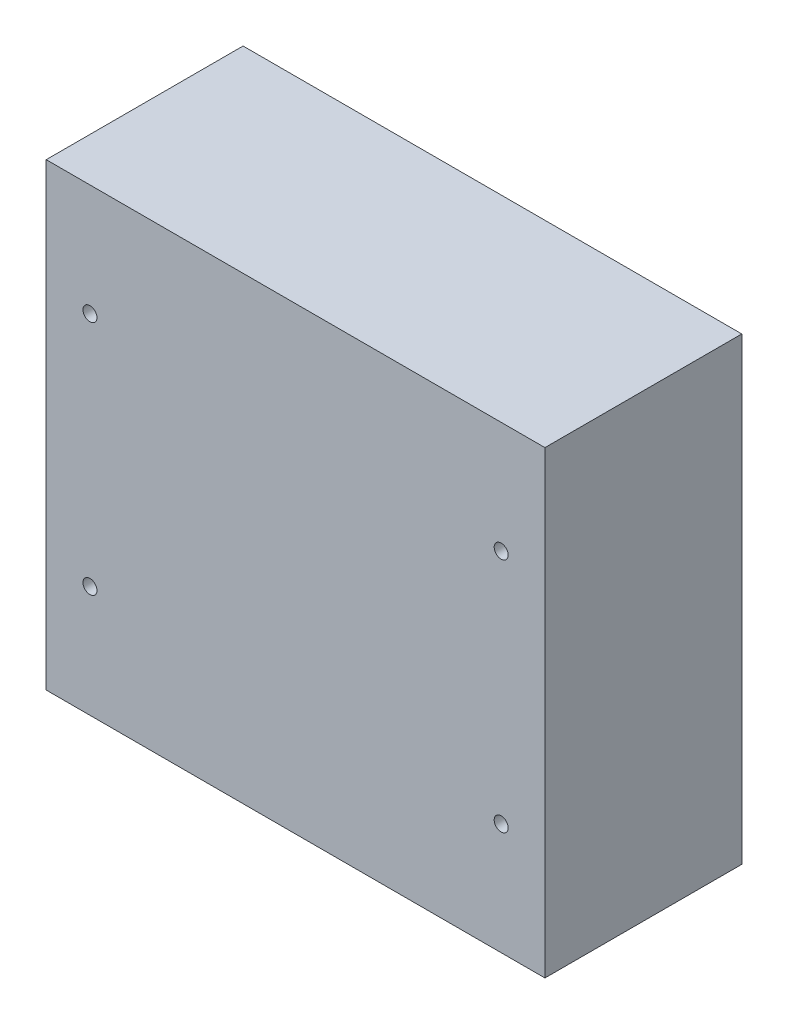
ISO-10303-21;
HEADER;
FILE_DESCRIPTION(('STEP AP214'),'2;1');
FILE_NAME('part.step','',(''),(''),'','','');
FILE_SCHEMA(('AUTOMOTIVE_DESIGN { 1 0 10303 214 1 1 1 1 }'));
ENDSEC;
DATA;
#1=APPLICATION_CONTEXT('core data for automotive mechanical design processes');
#2=APPLICATION_PROTOCOL_DEFINITION('international standard','automotive_design',2000,#1);
#3=PRODUCT_CONTEXT('',#1,'mechanical');
#4=PRODUCT('Part','Part','',(#3));
#5=PRODUCT_RELATED_PRODUCT_CATEGORY('part','',(#4));
#6=PRODUCT_DEFINITION_FORMATION('','',#4);
#7=PRODUCT_DEFINITION_CONTEXT('part definition',#1,'design');
#8=PRODUCT_DEFINITION('design','',#6,#7);
#9=PRODUCT_DEFINITION_SHAPE('','',#8);
#10=(LENGTH_UNIT() NAMED_UNIT(*) SI_UNIT(.MILLI.,.METRE.));
#11=(NAMED_UNIT(*) PLANE_ANGLE_UNIT() SI_UNIT($,.RADIAN.));
#12=(NAMED_UNIT(*) SI_UNIT($,.STERADIAN.) SOLID_ANGLE_UNIT());
#13=UNCERTAINTY_MEASURE_WITH_UNIT(LENGTH_MEASURE(1.E-05),#10,'distance_accuracy_value','');
#14=(GEOMETRIC_REPRESENTATION_CONTEXT(3) GLOBAL_UNCERTAINTY_ASSIGNED_CONTEXT((#13)) GLOBAL_UNIT_ASSIGNED_CONTEXT((#10,
#11,#12)) REPRESENTATION_CONTEXT('',''));
#15=CARTESIAN_POINT('',(0.,0.,0.));
#16=DIRECTION('',(0.,0.,1.));
#17=DIRECTION('',(1.,0.,0.));
#18=AXIS2_PLACEMENT_3D('',#15,#16,#17);
#19=CARTESIAN_POINT('',(27.,44.5,3.));
#20=DIRECTION('',(0.,0.,-1.));
#21=DIRECTION('',(0.,-1.,0.));
#22=AXIS2_PLACEMENT_3D('',#19,#20,#21);
#23=PLANE('',#22);
#24=CARTESIAN_POINT('',(27.,44.5,3.));
#25=DIRECTION('',(0.,0.,-1.));
#26=DIRECTION('',(-1.,0.,0.));
#27=AXIS2_PLACEMENT_3D('',#24,#25,#26);
#28=CIRCLE('',#27,1.1);
#29=CARTESIAN_POINT('',(25.9,44.5,3.));
#30=VERTEX_POINT('',#29);
#31=EDGE_CURVE('E282',#30,#30,#28,.T.);
#32=ORIENTED_EDGE('',*,*,#31,.T.);
#33=EDGE_LOOP('',(#32));
#34=FACE_BOUND('',#33,.T.);
#35=ADVANCED_FACE('F17',(#34),#23,.T.);
#36=CARTESIAN_POINT('',(-27.,44.5,3.));
#37=DIRECTION('',(0.,0.,1.));
#38=DIRECTION('',(1.,0.,0.));
#39=AXIS2_PLACEMENT_3D('',#36,#37,#38);
#40=PLANE('',#39);
#41=CARTESIAN_POINT('',(-27.,44.5,3.));
#42=DIRECTION('',(0.,0.,-1.));
#43=DIRECTION('',(1.,0.,0.));
#44=AXIS2_PLACEMENT_3D('',#41,#42,#43);
#45=CIRCLE('',#44,1.1);
#46=CARTESIAN_POINT('',(-25.9,44.5,3.));
#47=VERTEX_POINT('',#46);
#48=EDGE_CURVE('E264',#47,#47,#45,.T.);
#49=ORIENTED_EDGE('',*,*,#48,.T.);
#50=EDGE_LOOP('',(#49));
#51=FACE_BOUND('',#50,.T.);
#52=ADVANCED_FACE('F325',(#51),#40,.F.);
#53=CARTESIAN_POINT('',(-47.,-27.,35.));
#54=DIRECTION('',(0.,0.,1.));
#55=DIRECTION('',(1.,0.,0.));
#56=AXIS2_PLACEMENT_3D('',#53,#54,#55);
#57=PLANE('',#56);
#58=CARTESIAN_POINT('',(-47.,-27.,35.));
#59=DIRECTION('',(0.,0.,1.));
#60=DIRECTION('',(1.,0.,0.));
#61=AXIS2_PLACEMENT_3D('',#58,#59,#60);
#62=CIRCLE('',#61,1.6);
#63=CARTESIAN_POINT('',(-45.4,-27.,35.));
#64=VERTEX_POINT('',#63);
#65=EDGE_CURVE('E243',#64,#64,#62,.T.);
#66=ORIENTED_EDGE('',*,*,#65,.T.);
#67=EDGE_LOOP('',(#66));
#68=FACE_BOUND('',#67,.T.);
#69=ADVANCED_FACE('F329',(#68),#57,.T.);
#70=CARTESIAN_POINT('',(47.,-27.,35.));
#71=DIRECTION('',(0.,0.,1.));
#72=DIRECTION('',(1.,0.,0.));
#73=AXIS2_PLACEMENT_3D('',#70,#71,#72);
#74=PLANE('',#73);
#75=CARTESIAN_POINT('',(47.,-27.,35.));
#76=DIRECTION('',(0.,0.,1.));
#77=DIRECTION('',(1.,0.,0.));
#78=AXIS2_PLACEMENT_3D('',#75,#76,#77);
#79=CIRCLE('',#78,1.6);
#80=CARTESIAN_POINT('',(48.6,-27.,35.));
#81=VERTEX_POINT('',#80);
#82=EDGE_CURVE('E222',#81,#81,#79,.T.);
#83=ORIENTED_EDGE('',*,*,#82,.T.);
#84=EDGE_LOOP('',(#83));
#85=FACE_BOUND('',#84,.T.);
#86=ADVANCED_FACE('F334',(#85),#74,.T.);
#87=CARTESIAN_POINT('',(47.,27.,35.));
#88=DIRECTION('',(0.,0.,1.));
#89=DIRECTION('',(1.,0.,0.));
#90=AXIS2_PLACEMENT_3D('',#87,#88,#89);
#91=PLANE('',#90);
#92=CARTESIAN_POINT('',(47.,27.,35.));
#93=DIRECTION('',(0.,0.,1.));
#94=DIRECTION('',(1.,0.,0.));
#95=AXIS2_PLACEMENT_3D('',#92,#93,#94);
#96=CIRCLE('',#95,1.6);
#97=CARTESIAN_POINT('',(48.6,27.,35.));
#98=VERTEX_POINT('',#97);
#99=EDGE_CURVE('E202',#98,#98,#96,.T.);
#100=ORIENTED_EDGE('',*,*,#99,.T.);
#101=EDGE_LOOP('',(#100));
#102=FACE_BOUND('',#101,.T.);
#103=ADVANCED_FACE('F340',(#102),#91,.T.);
#104=CARTESIAN_POINT('',(-47.,27.,35.));
#105=DIRECTION('',(0.,0.,1.));
#106=DIRECTION('',(1.,0.,0.));
#107=AXIS2_PLACEMENT_3D('',#104,#105,#106);
#108=PLANE('',#107);
#109=CARTESIAN_POINT('',(-47.,27.,35.));
#110=DIRECTION('',(0.,0.,1.));
#111=DIRECTION('',(1.,0.,0.));
#112=AXIS2_PLACEMENT_3D('',#109,#110,#111);
#113=CIRCLE('',#112,1.6);
#114=CARTESIAN_POINT('',(-45.4,27.,35.));
#115=VERTEX_POINT('',#114);
#116=EDGE_CURVE('E181',#115,#115,#113,.T.);
#117=ORIENTED_EDGE('',*,*,#116,.T.);
#118=EDGE_LOOP('',(#117));
#119=FACE_BOUND('',#118,.T.);
#120=ADVANCED_FACE('F342',(#119),#108,.T.);
#121=CARTESIAN_POINT('',(0.,0.,0.));
#122=DIRECTION('',(0.,0.,-1.));
#123=DIRECTION('',(0.,-1.,0.));
#124=AXIS2_PLACEMENT_3D('',#121,#122,#123);
#125=PLANE('',#124);
#126=CARTESIAN_POINT('',(-27.,44.5,0.));
#127=DIRECTION('',(0.,0.,-1.));
#128=DIRECTION('',(1.,0.,0.));
#129=AXIS2_PLACEMENT_3D('',#126,#127,#128);
#130=CIRCLE('',#129,1.1);
#131=CARTESIAN_POINT('',(-25.9,44.5,0.));
#132=VERTEX_POINT('',#131);
#133=EDGE_CURVE('E254',#132,#132,#130,.T.);
#134=ORIENTED_EDGE('',*,*,#133,.F.);
#135=EDGE_LOOP('',(#134));
#136=FACE_BOUND('',#135,.T.);
#137=CARTESIAN_POINT('',(27.,44.5,0.));
#138=DIRECTION('',(0.,0.,-1.));
#139=DIRECTION('',(-1.,0.,0.));
#140=AXIS2_PLACEMENT_3D('',#137,#138,#139);
#141=CIRCLE('',#140,1.1);
#142=CARTESIAN_POINT('',(25.9,44.5,0.));
#143=VERTEX_POINT('',#142);
#144=EDGE_CURVE('E273',#143,#143,#141,.T.);
#145=ORIENTED_EDGE('',*,*,#144,.F.);
#146=EDGE_LOOP('',(#145));
#147=FACE_BOUND('',#146,.T.);
#148=DIRECTION('',(0.,1.,0.));
#149=VECTOR('',#148,1.);
#150=CARTESIAN_POINT('',(57.,-52.5,0.));
#151=LINE('',#150,#149);
#152=CARTESIAN_POINT('',(57.,-52.5,0.));
#153=VERTEX_POINT('',#152);
#154=CARTESIAN_POINT('',(57.,52.5,0.));
#155=VERTEX_POINT('',#154);
#156=EDGE_CURVE('E95',#153,#155,#151,.T.);
#157=ORIENTED_EDGE('',*,*,#156,.F.);
#158=DIRECTION('',(1.,0.,0.));
#159=VECTOR('',#158,1.);
#160=CARTESIAN_POINT('',(-57.,-52.5,0.));
#161=LINE('',#160,#159);
#162=CARTESIAN_POINT('',(-57.,-52.5,0.));
#163=VERTEX_POINT('',#162);
#164=EDGE_CURVE('E25',#163,#153,#161,.T.);
#165=ORIENTED_EDGE('',*,*,#164,.F.);
#166=DIRECTION('',(0.,-1.,0.));
#167=VECTOR('',#166,1.);
#168=CARTESIAN_POINT('',(-57.,-52.5,0.));
#169=LINE('',#168,#167);
#170=CARTESIAN_POINT('',(-57.,52.5,0.));
#171=VERTEX_POINT('',#170);
#172=EDGE_CURVE('E104',#171,#163,#169,.T.);
#173=ORIENTED_EDGE('',*,*,#172,.F.);
#174=DIRECTION('',(-1.,0.,0.));
#175=VECTOR('',#174,1.);
#176=CARTESIAN_POINT('',(-57.,52.5,0.));
#177=LINE('',#176,#175);
#178=EDGE_CURVE('E84',#155,#171,#177,.T.);
#179=ORIENTED_EDGE('',*,*,#178,.F.);
#180=EDGE_LOOP('',(#157,#165,#173,#179));
#181=FACE_BOUND('',#180,.T.);
#182=ADVANCED_FACE('F345',(#136,#147,#181),#125,.T.);
#183=CARTESIAN_POINT('',(0.,0.,45.));
#184=DIRECTION('',(0.,0.,-1.));
#185=DIRECTION('',(0.,-1.,0.));
#186=AXIS2_PLACEMENT_3D('',#183,#184,#185);
#187=PLANE('',#186);
#188=CARTESIAN_POINT('',(-47.,27.,45.));
#189=DIRECTION('',(0.,0.,1.));
#190=DIRECTION('',(1.,0.,0.));
#191=AXIS2_PLACEMENT_3D('',#188,#189,#190);
#192=CIRCLE('',#191,1.6);
#193=CARTESIAN_POINT('',(-45.4,27.,45.));
#194=VERTEX_POINT('',#193);
#195=EDGE_CURVE('E173',#194,#194,#192,.T.);
#196=ORIENTED_EDGE('',*,*,#195,.F.);
#197=EDGE_LOOP('',(#196));
#198=FACE_BOUND('',#197,.T.);
#199=CARTESIAN_POINT('',(47.,27.,45.));
#200=DIRECTION('',(0.,0.,1.));
#201=DIRECTION('',(1.,0.,0.));
#202=AXIS2_PLACEMENT_3D('',#199,#200,#201);
#203=CIRCLE('',#202,1.6);
#204=CARTESIAN_POINT('',(48.6,27.,45.));
#205=VERTEX_POINT('',#204);
#206=EDGE_CURVE('E192',#205,#205,#203,.T.);
#207=ORIENTED_EDGE('',*,*,#206,.F.);
#208=EDGE_LOOP('',(#207));
#209=FACE_BOUND('',#208,.T.);
#210=CARTESIAN_POINT('',(47.,-27.,45.));
#211=DIRECTION('',(0.,0.,1.));
#212=DIRECTION('',(1.,0.,0.));
#213=AXIS2_PLACEMENT_3D('',#210,#211,#212);
#214=CIRCLE('',#213,1.6);
#215=CARTESIAN_POINT('',(48.6,-27.,45.));
#216=VERTEX_POINT('',#215);
#217=EDGE_CURVE('E212',#216,#216,#214,.T.);
#218=ORIENTED_EDGE('',*,*,#217,.F.);
#219=EDGE_LOOP('',(#218));
#220=FACE_BOUND('',#219,.T.);
#221=CARTESIAN_POINT('',(-47.,-27.,45.));
#222=DIRECTION('',(0.,0.,1.));
#223=DIRECTION('',(1.,0.,0.));
#224=AXIS2_PLACEMENT_3D('',#221,#222,#223);
#225=CIRCLE('',#224,1.6);
#226=CARTESIAN_POINT('',(-45.4,-27.,45.));
#227=VERTEX_POINT('',#226);
#228=EDGE_CURVE('E232',#227,#227,#225,.T.);
#229=ORIENTED_EDGE('',*,*,#228,.F.);
#230=EDGE_LOOP('',(#229));
#231=FACE_BOUND('',#230,.T.);
#232=DIRECTION('',(0.,1.,0.));
#233=VECTOR('',#232,1.);
#234=CARTESIAN_POINT('',(57.,-52.5,45.));
#235=LINE('',#234,#233);
#236=CARTESIAN_POINT('',(57.,-52.5,45.));
#237=VERTEX_POINT('',#236);
#238=CARTESIAN_POINT('',(57.,52.5,45.));
#239=VERTEX_POINT('',#238);
#240=EDGE_CURVE('E74',#237,#239,#235,.T.);
#241=ORIENTED_EDGE('',*,*,#240,.T.);
#242=DIRECTION('',(-1.,0.,0.));
#243=VECTOR('',#242,1.);
#244=CARTESIAN_POINT('',(-57.,52.5,45.));
#245=LINE('',#244,#243);
#246=CARTESIAN_POINT('',(-57.,52.5,45.));
#247=VERTEX_POINT('',#246);
#248=EDGE_CURVE('E103',#239,#247,#245,.T.);
#249=ORIENTED_EDGE('',*,*,#248,.T.);
#250=DIRECTION('',(0.,-1.,0.));
#251=VECTOR('',#250,1.);
#252=CARTESIAN_POINT('',(-57.,-52.5,45.));
#253=LINE('',#252,#251);
#254=CARTESIAN_POINT('',(-57.,-52.5,45.));
#255=VERTEX_POINT('',#254);
#256=EDGE_CURVE('E76',#247,#255,#253,.T.);
#257=ORIENTED_EDGE('',*,*,#256,.T.);
#258=DIRECTION('',(1.,0.,0.));
#259=VECTOR('',#258,1.);
#260=CARTESIAN_POINT('',(-57.,-52.5,45.));
#261=LINE('',#260,#259);
#262=EDGE_CURVE('E11',#255,#237,#261,.T.);
#263=ORIENTED_EDGE('',*,*,#262,.T.);
#264=EDGE_LOOP('',(#241,#249,#257,#263));
#265=FACE_BOUND('',#264,.T.);
#266=ADVANCED_FACE('F71',(#198,#209,#220,#231,#265),#187,.F.);
#267=CARTESIAN_POINT('',(-57.,-52.5,45.));
#268=DIRECTION('',(0.,1.,0.));
#269=DIRECTION('',(1.,0.,0.));
#270=AXIS2_PLACEMENT_3D('',#267,#268,#269);
#271=PLANE('',#270);
#272=ORIENTED_EDGE('',*,*,#164,.T.);
#273=DIRECTION('',(0.,0.,-1.));
#274=VECTOR('',#273,1.);
#275=CARTESIAN_POINT('',(57.,-52.5,45.));
#276=LINE('',#275,#274);
#277=EDGE_CURVE('E79',#237,#153,#276,.T.);
#278=ORIENTED_EDGE('',*,*,#277,.F.);
#279=ORIENTED_EDGE('',*,*,#262,.F.);
#280=DIRECTION('',(0.,0.,-1.));
#281=VECTOR('',#280,1.);
#282=CARTESIAN_POINT('',(-57.,-52.5,45.));
#283=LINE('',#282,#281);
#284=EDGE_CURVE('E108',#255,#163,#283,.T.);
#285=ORIENTED_EDGE('',*,*,#284,.T.);
#286=EDGE_LOOP('',(#272,#278,#279,#285));
#287=FACE_BOUND('',#286,.T.);
#288=ADVANCED_FACE('F80',(#287),#271,.F.);
#289=CARTESIAN_POINT('',(-57.,-52.5,45.));
#290=DIRECTION('',(1.,0.,0.));
#291=DIRECTION('',(0.,1.,0.));
#292=AXIS2_PLACEMENT_3D('',#289,#290,#291);
#293=PLANE('',#292);
#294=ORIENTED_EDGE('',*,*,#172,.T.);
#295=ORIENTED_EDGE('',*,*,#284,.F.);
#296=ORIENTED_EDGE('',*,*,#256,.F.);
#297=DIRECTION('',(0.,0.,-1.));
#298=VECTOR('',#297,1.);
#299=CARTESIAN_POINT('',(-57.,52.5,45.));
#300=LINE('',#299,#298);
#301=EDGE_CURVE('E99',#247,#171,#300,.T.);
#302=ORIENTED_EDGE('',*,*,#301,.T.);
#303=EDGE_LOOP('',(#294,#295,#296,#302));
#304=FACE_BOUND('',#303,.T.);
#305=ADVANCED_FACE('F347',(#304),#293,.F.);
#306=CARTESIAN_POINT('',(-57.,52.5,45.));
#307=DIRECTION('',(0.,-1.,0.));
#308=DIRECTION('',(0.,0.,-1.));
#309=AXIS2_PLACEMENT_3D('',#306,#307,#308);
#310=PLANE('',#309);
#311=ORIENTED_EDGE('',*,*,#178,.T.);
#312=ORIENTED_EDGE('',*,*,#301,.F.);
#313=ORIENTED_EDGE('',*,*,#248,.F.);
#314=DIRECTION('',(0.,0.,-1.));
#315=VECTOR('',#314,1.);
#316=CARTESIAN_POINT('',(57.,52.5,45.));
#317=LINE('',#316,#315);
#318=EDGE_CURVE('E88',#239,#155,#317,.T.);
#319=ORIENTED_EDGE('',*,*,#318,.T.);
#320=EDGE_LOOP('',(#311,#312,#313,#319));
#321=FACE_BOUND('',#320,.T.);
#322=ADVANCED_FACE('F350',(#321),#310,.F.);
#323=CARTESIAN_POINT('',(57.,-52.5,45.));
#324=DIRECTION('',(-1.,0.,0.));
#325=DIRECTION('',(0.,0.,1.));
#326=AXIS2_PLACEMENT_3D('',#323,#324,#325);
#327=PLANE('',#326);
#328=ORIENTED_EDGE('',*,*,#156,.T.);
#329=ORIENTED_EDGE('',*,*,#318,.F.);
#330=ORIENTED_EDGE('',*,*,#240,.F.);
#331=ORIENTED_EDGE('',*,*,#277,.T.);
#332=EDGE_LOOP('',(#328,#329,#330,#331));
#333=FACE_BOUND('',#332,.T.);
#334=ADVANCED_FACE('F86',(#333),#327,.F.);
#335=CARTESIAN_POINT('',(-47.,27.,35.));
#336=DIRECTION('',(0.,0.,1.));
#337=DIRECTION('',(1.,0.,0.));
#338=AXIS2_PLACEMENT_3D('',#335,#336,#337);
#339=CYLINDRICAL_SURFACE('',#338,1.6);
#340=ORIENTED_EDGE('',*,*,#195,.T.);
#341=EDGE_LOOP('',(#340));
#342=FACE_BOUND('',#341,.T.);
#343=ORIENTED_EDGE('',*,*,#116,.F.);
#344=EDGE_LOOP('',(#343));
#345=FACE_BOUND('',#344,.T.);
#346=ADVANCED_FACE('F352',(#342,#345),#339,.F.);
#347=CARTESIAN_POINT('',(47.,27.,35.));
#348=DIRECTION('',(0.,0.,1.));
#349=DIRECTION('',(1.,0.,0.));
#350=AXIS2_PLACEMENT_3D('',#347,#348,#349);
#351=CYLINDRICAL_SURFACE('',#350,1.6);
#352=ORIENTED_EDGE('',*,*,#206,.T.);
#353=EDGE_LOOP('',(#352));
#354=FACE_BOUND('',#353,.T.);
#355=ORIENTED_EDGE('',*,*,#99,.F.);
#356=EDGE_LOOP('',(#355));
#357=FACE_BOUND('',#356,.T.);
#358=ADVANCED_FACE('F355',(#354,#357),#351,.F.);
#359=CARTESIAN_POINT('',(47.,-27.,35.));
#360=DIRECTION('',(0.,0.,1.));
#361=DIRECTION('',(1.,0.,0.));
#362=AXIS2_PLACEMENT_3D('',#359,#360,#361);
#363=CYLINDRICAL_SURFACE('',#362,1.6);
#364=ORIENTED_EDGE('',*,*,#217,.T.);
#365=EDGE_LOOP('',(#364));
#366=FACE_BOUND('',#365,.T.);
#367=ORIENTED_EDGE('',*,*,#82,.F.);
#368=EDGE_LOOP('',(#367));
#369=FACE_BOUND('',#368,.T.);
#370=ADVANCED_FACE('F362',(#366,#369),#363,.F.);
#371=CARTESIAN_POINT('',(-47.,-27.,35.));
#372=DIRECTION('',(0.,0.,1.));
#373=DIRECTION('',(1.,0.,0.));
#374=AXIS2_PLACEMENT_3D('',#371,#372,#373);
#375=CYLINDRICAL_SURFACE('',#374,1.6);
#376=ORIENTED_EDGE('',*,*,#228,.T.);
#377=EDGE_LOOP('',(#376));
#378=FACE_BOUND('',#377,.T.);
#379=ORIENTED_EDGE('',*,*,#65,.F.);
#380=EDGE_LOOP('',(#379));
#381=FACE_BOUND('',#380,.T.);
#382=ADVANCED_FACE('F321',(#378,#381),#375,.F.);
#383=CARTESIAN_POINT('',(-27.,44.5,3.));
#384=DIRECTION('',(0.,0.,-1.));
#385=DIRECTION('',(-1.,0.,0.));
#386=AXIS2_PLACEMENT_3D('',#383,#384,#385);
#387=CYLINDRICAL_SURFACE('',#386,1.1);
#388=ORIENTED_EDGE('',*,*,#133,.T.);
#389=EDGE_LOOP('',(#388));
#390=FACE_BOUND('',#389,.T.);
#391=ORIENTED_EDGE('',*,*,#48,.F.);
#392=EDGE_LOOP('',(#391));
#393=FACE_BOUND('',#392,.T.);
#394=ADVANCED_FACE('F314',(#390,#393),#387,.F.);
#395=CARTESIAN_POINT('',(27.,44.5,3.));
#396=DIRECTION('',(0.,0.,-1.));
#397=DIRECTION('',(-1.,0.,0.));
#398=AXIS2_PLACEMENT_3D('',#395,#396,#397);
#399=CYLINDRICAL_SURFACE('',#398,1.1);
#400=ORIENTED_EDGE('',*,*,#144,.T.);
#401=EDGE_LOOP('',(#400));
#402=FACE_BOUND('',#401,.T.);
#403=ORIENTED_EDGE('',*,*,#31,.F.);
#404=EDGE_LOOP('',(#403));
#405=FACE_BOUND('',#404,.T.);
#406=ADVANCED_FACE('F312',(#402,#405),#399,.F.);
#407=CLOSED_SHELL('',(#35,#52,#69,#86,#103,#120,#182,#266,#288,#305,#322,#334,#346,#358,#370,
#382,#394,#406));
#408=MANIFOLD_SOLID_BREP('B1',#407);
#409=ADVANCED_BREP_SHAPE_REPRESENTATION('',(#18,#408),#14);
#410=SHAPE_DEFINITION_REPRESENTATION(#9,#409);
ENDSEC;
END-ISO-10303-21;
